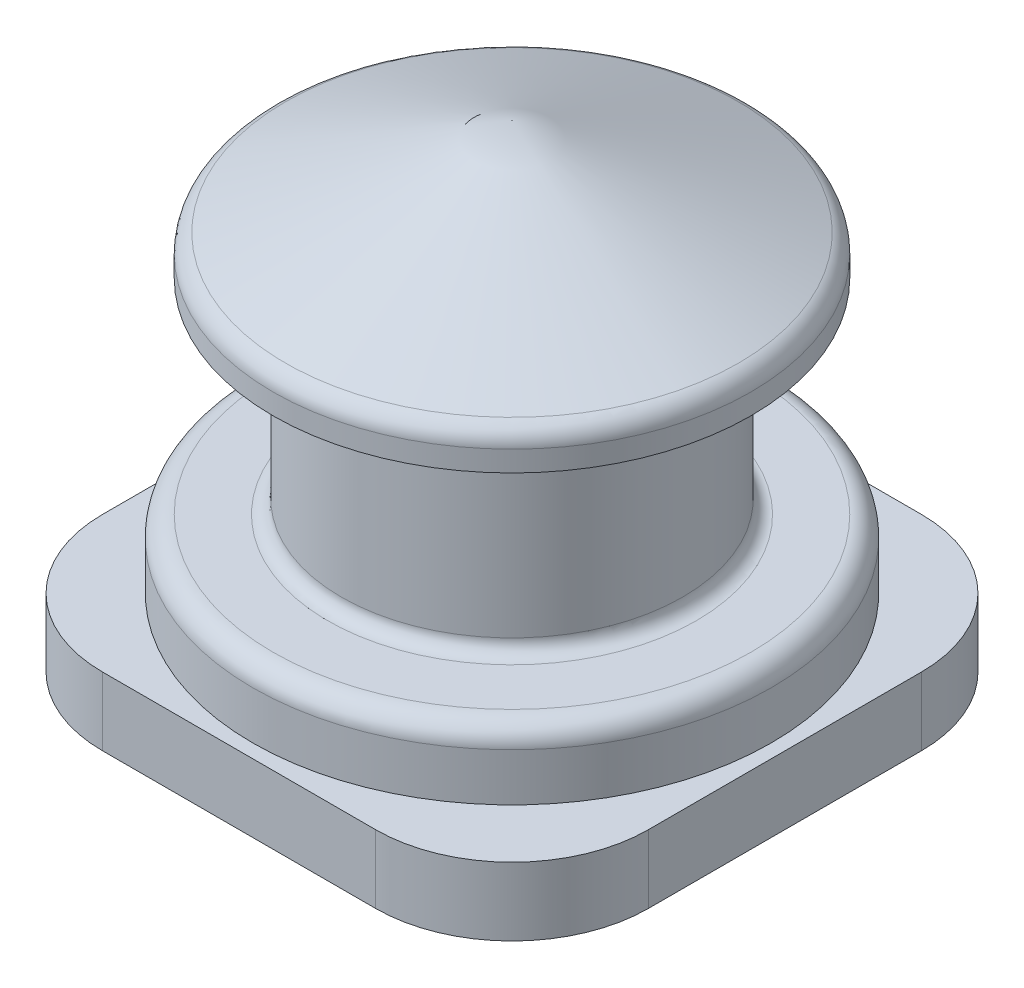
from build123d import *

# Parameters (mm, degrees)
ESQUISSE2_W                  = 80
ESQUISSE2_H                  = 80
BOSS_EXTRU_1_DEPTH           = 10
CONG_1_R                     = 20
CONG_2_R                     = 2
CONG_3_R                     = 3
R_P_TITION_CIRCULAIRE1_COUNT = 4


with BuildPart() as part:
    # Esquisse1 → R_volution1 (revolve)
    with BuildSketch(Plane.XY, mode=Mode.PRIVATE) as r_volution1_sk:
        Polygon((0, 0), (38, 0), (38, 10), (25, 10), (25, 40), (35, 40), (35, 45), (0, 60), align=None)
    revolve(r_volution1_sk.sketch.rotate(Axis((0, 60, 0), (0, -1, 0)), 180), axis=Axis((0, 60, 0), (0, -1, 0)))

    # Esquisse2 → Boss.-Extru.1 (add)
    with BuildSketch(Plane.XZ):
        Rectangle(ESQUISSE2_W, ESQUISSE2_H)
    extrude(amount=BOSS_EXTRU_1_DEPTH)

    # Cong_1
    cong_1_edges = [part.edges().sort_by_distance(p)[0] for p in [
        (40, -5, -40),
        (40, -5, 40),
        (-40, -5, 40),
        (-40, -5, -40),
    ]]
    fillet(cong_1_edges, radius=CONG_1_R)

    # Cong_2
    cong_2_edges = [part.edges().sort_by_distance(p)[0] for p in [
        (25, 40, 0),
        (25, 10, 0),
    ]]
    fillet(cong_2_edges, radius=CONG_2_R)

    # Cong_3
    cong_3_edges = [part.edges().sort_by_distance(p)[0] for p in [
        (35, 45, 0),
        (38, 10, 0),
    ]]
    fillet(cong_3_edges, radius=CONG_3_R)

    # Esquisse4 → Trou taraud_ M61 (revolve, cut)
    with BuildSketch(Plane(origin=(-24.748737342, -10, -24.748737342), x_dir=(0, 0, -1), z_dir=(1, 0, 0))):
        Polygon((0, 0), (0, 18.502151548), (2.5, 17), (2.5, 0), align=None)
    trou_taraud_m61 = revolve(axis=Axis((-24.748737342, -16.35, -24.748737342), (0, 1, 0)), mode=Mode.SUBTRACT)

    # R_p_tition circulaire1: Trou taraud_ M61 ×4 about axis
    r_p_tition_circulaire1_axis = Axis((0, 0, 0), (0, 1, 0))
    for i in range(1, R_P_TITION_CIRCULAIRE1_COUNT):
        add(trou_taraud_m61.rotate(r_p_tition_circulaire1_axis, i * 360 / R_P_TITION_CIRCULAIRE1_COUNT), mode=Mode.SUBTRACT)


solid = part.part
